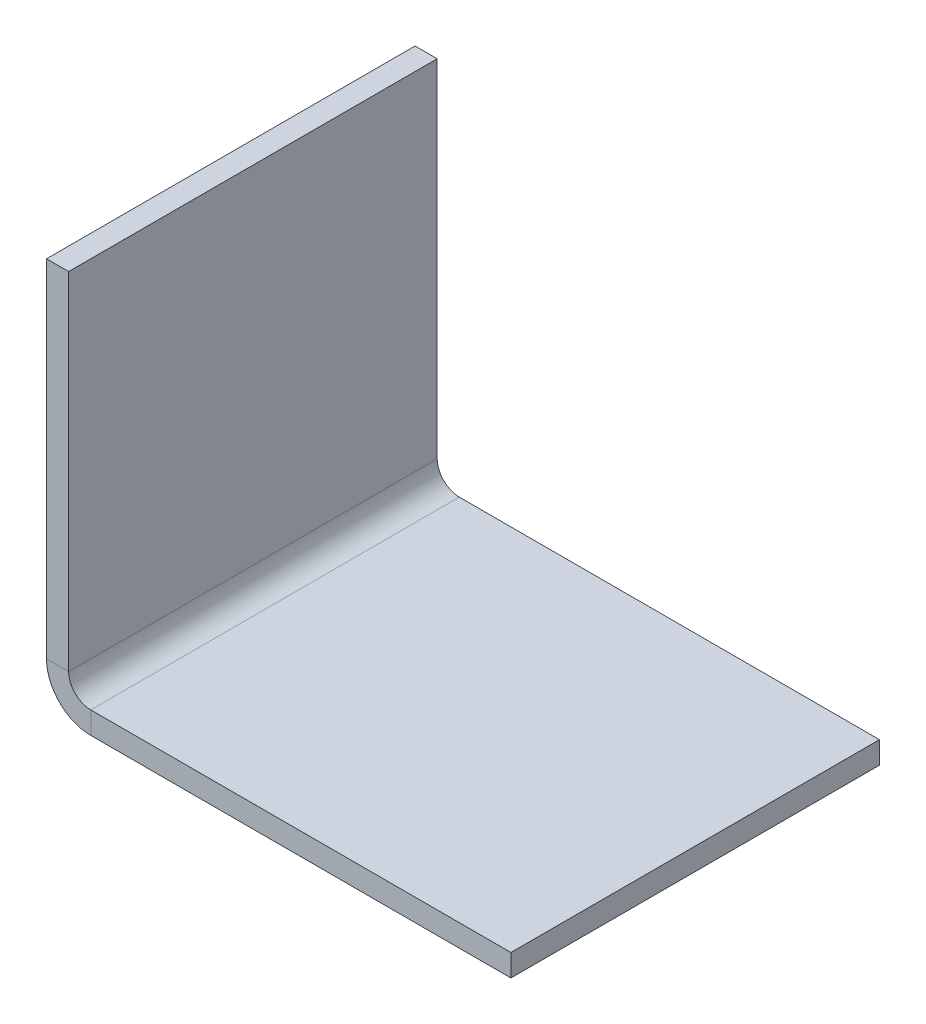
ISO-10303-21;
HEADER;
FILE_DESCRIPTION(('STEP AP214'),'2;1');
FILE_NAME('part.step','',(''),(''),'','','');
FILE_SCHEMA(('AUTOMOTIVE_DESIGN { 1 0 10303 214 1 1 1 1 }'));
ENDSEC;
DATA;
#1=APPLICATION_CONTEXT('core data for automotive mechanical design processes');
#2=APPLICATION_PROTOCOL_DEFINITION('international standard','automotive_design',2000,#1);
#3=PRODUCT_CONTEXT('',#1,'mechanical');
#4=PRODUCT('Part','Part','',(#3));
#5=PRODUCT_RELATED_PRODUCT_CATEGORY('part','',(#4));
#6=PRODUCT_DEFINITION_FORMATION('','',#4);
#7=PRODUCT_DEFINITION_CONTEXT('part definition',#1,'design');
#8=PRODUCT_DEFINITION('design','',#6,#7);
#9=PRODUCT_DEFINITION_SHAPE('','',#8);
#10=(LENGTH_UNIT() NAMED_UNIT(*) SI_UNIT(.MILLI.,.METRE.));
#11=(NAMED_UNIT(*) PLANE_ANGLE_UNIT() SI_UNIT($,.RADIAN.));
#12=(NAMED_UNIT(*) SI_UNIT($,.STERADIAN.) SOLID_ANGLE_UNIT());
#13=UNCERTAINTY_MEASURE_WITH_UNIT(LENGTH_MEASURE(1.E-05),#10,'distance_accuracy_value','');
#14=(GEOMETRIC_REPRESENTATION_CONTEXT(3) GLOBAL_UNCERTAINTY_ASSIGNED_CONTEXT((#13)) GLOBAL_UNIT_ASSIGNED_CONTEXT((#10,
#11,#12)) REPRESENTATION_CONTEXT('',''));
#15=CARTESIAN_POINT('',(0.,0.,0.));
#16=DIRECTION('',(0.,0.,1.));
#17=DIRECTION('',(1.,0.,0.));
#18=AXIS2_PLACEMENT_3D('',#15,#16,#17);
#19=CARTESIAN_POINT('',(3.,0.,50.));
#20=DIRECTION('',(0.,0.,1.));
#21=DIRECTION('',(1.,0.,0.));
#22=AXIS2_PLACEMENT_3D('',#19,#20,#21);
#23=PLANE('',#22);
#24=DIRECTION('',(0.,-1.,0.));
#25=VECTOR('',#24,1.);
#26=CARTESIAN_POINT('',(3.,0.,50.));
#27=LINE('',#26,#25);
#28=CARTESIAN_POINT('',(3.,0.,50.));
#29=VERTEX_POINT('',#28);
#30=CARTESIAN_POINT('',(3.,-3.,50.));
#31=VERTEX_POINT('',#30);
#32=EDGE_CURVE('E11',#29,#31,#27,.T.);
#33=ORIENTED_EDGE('',*,*,#32,.F.);
#34=CARTESIAN_POINT('',(3.,3.,50.));
#35=DIRECTION('',(0.,0.,-1.));
#36=DIRECTION('',(-1.,0.,0.));
#37=AXIS2_PLACEMENT_3D('',#34,#35,#36);
#38=CIRCLE('',#37,3.);
#39=CARTESIAN_POINT('',(0.,3.,50.));
#40=VERTEX_POINT('',#39);
#41=EDGE_CURVE('E138',#40,#29,#38,.F.);
#42=ORIENTED_EDGE('',*,*,#41,.F.);
#43=DIRECTION('',(1.,0.,0.));
#44=VECTOR('',#43,1.);
#45=CARTESIAN_POINT('',(-3.,3.,50.));
#46=LINE('',#45,#44);
#47=CARTESIAN_POINT('',(-3.,3.,50.));
#48=VERTEX_POINT('',#47);
#49=EDGE_CURVE('E35',#48,#40,#46,.T.);
#50=ORIENTED_EDGE('',*,*,#49,.F.);
#51=CARTESIAN_POINT('',(3.,3.,50.));
#52=DIRECTION('',(0.,0.,1.));
#53=DIRECTION('',(1.,0.,0.));
#54=AXIS2_PLACEMENT_3D('',#51,#52,#53);
#55=CIRCLE('',#54,6.);
#56=EDGE_CURVE('E149',#48,#31,#55,.T.);
#57=ORIENTED_EDGE('',*,*,#56,.T.);
#58=EDGE_LOOP('',(#33,#42,#50,#57));
#59=FACE_BOUND('',#58,.T.);
#60=ADVANCED_FACE('F28',(#59),#23,.T.);
#61=CARTESIAN_POINT('',(-3.,3.,50.));
#62=DIRECTION('',(0.,0.,1.));
#63=DIRECTION('',(1.,0.,0.));
#64=AXIS2_PLACEMENT_3D('',#61,#62,#63);
#65=PLANE('',#64);
#66=DIRECTION('',(1.,0.,0.));
#67=VECTOR('',#66,1.);
#68=CARTESIAN_POINT('',(0.,0.,50.));
#69=LINE('',#68,#67);
#70=CARTESIAN_POINT('',(60.,0.,50.));
#71=VERTEX_POINT('',#70);
#72=EDGE_CURVE('E135',#29,#71,#69,.T.);
#73=ORIENTED_EDGE('',*,*,#72,.F.);
#74=ORIENTED_EDGE('',*,*,#32,.T.);
#75=DIRECTION('',(1.,0.,0.));
#76=VECTOR('',#75,1.);
#77=CARTESIAN_POINT('',(0.,-3.,50.));
#78=LINE('',#77,#76);
#79=CARTESIAN_POINT('',(60.,-3.,50.));
#80=VERTEX_POINT('',#79);
#81=EDGE_CURVE('E132',#31,#80,#78,.T.);
#82=ORIENTED_EDGE('',*,*,#81,.T.);
#83=DIRECTION('',(0.,-1.,0.));
#84=VECTOR('',#83,1.);
#85=CARTESIAN_POINT('',(60.,0.,50.));
#86=LINE('',#85,#84);
#87=EDGE_CURVE('E97',#71,#80,#86,.T.);
#88=ORIENTED_EDGE('',*,*,#87,.F.);
#89=EDGE_LOOP('',(#73,#74,#82,#88));
#90=FACE_BOUND('',#89,.T.);
#91=ADVANCED_FACE('F192',(#90),#65,.T.);
#92=CARTESIAN_POINT('',(0.,3.,0.));
#93=DIRECTION('',(0.,0.,-1.));
#94=DIRECTION('',(-1.,0.,0.));
#95=AXIS2_PLACEMENT_3D('',#92,#93,#94);
#96=PLANE('',#95);
#97=DIRECTION('',(-1.,0.,0.));
#98=VECTOR('',#97,1.);
#99=CARTESIAN_POINT('',(0.,3.,0.));
#100=LINE('',#99,#98);
#101=CARTESIAN_POINT('',(0.,3.,0.));
#102=VERTEX_POINT('',#101);
#103=CARTESIAN_POINT('',(-3.,3.,0.));
#104=VERTEX_POINT('',#103);
#105=EDGE_CURVE('E167',#102,#104,#100,.T.);
#106=ORIENTED_EDGE('',*,*,#105,.F.);
#107=CARTESIAN_POINT('',(3.,3.,0.));
#108=DIRECTION('',(0.,0.,-1.));
#109=DIRECTION('',(-1.,0.,0.));
#110=AXIS2_PLACEMENT_3D('',#107,#108,#109);
#111=CIRCLE('',#110,3.);
#112=CARTESIAN_POINT('',(3.,0.,0.));
#113=VERTEX_POINT('',#112);
#114=EDGE_CURVE('E115',#102,#113,#111,.F.);
#115=ORIENTED_EDGE('',*,*,#114,.T.);
#116=DIRECTION('',(0.,1.,0.));
#117=VECTOR('',#116,1.);
#118=CARTESIAN_POINT('',(3.,-3.,0.));
#119=LINE('',#118,#117);
#120=CARTESIAN_POINT('',(3.,-3.,0.));
#121=VERTEX_POINT('',#120);
#122=EDGE_CURVE('E100',#121,#113,#119,.T.);
#123=ORIENTED_EDGE('',*,*,#122,.F.);
#124=CARTESIAN_POINT('',(3.,3.,0.));
#125=DIRECTION('',(0.,0.,1.));
#126=DIRECTION('',(1.,0.,0.));
#127=AXIS2_PLACEMENT_3D('',#124,#125,#126);
#128=CIRCLE('',#127,6.);
#129=EDGE_CURVE('E129',#104,#121,#128,.T.);
#130=ORIENTED_EDGE('',*,*,#129,.F.);
#131=EDGE_LOOP('',(#106,#115,#123,#130));
#132=FACE_BOUND('',#131,.T.);
#133=ADVANCED_FACE('F196',(#132),#96,.T.);
#134=CARTESIAN_POINT('',(3.,-3.,0.));
#135=DIRECTION('',(0.,0.,-1.));
#136=DIRECTION('',(-1.,0.,0.));
#137=AXIS2_PLACEMENT_3D('',#134,#135,#136);
#138=PLANE('',#137);
#139=DIRECTION('',(0.,-1.,0.));
#140=VECTOR('',#139,1.);
#141=CARTESIAN_POINT('',(0.,50.,0.));
#142=LINE('',#141,#140);
#143=CARTESIAN_POINT('',(0.,50.,0.));
#144=VERTEX_POINT('',#143);
#145=EDGE_CURVE('E120',#144,#102,#142,.T.);
#146=ORIENTED_EDGE('',*,*,#145,.T.);
#147=ORIENTED_EDGE('',*,*,#105,.T.);
#148=DIRECTION('',(0.,-1.,0.));
#149=VECTOR('',#148,1.);
#150=CARTESIAN_POINT('',(-3.,50.,0.));
#151=LINE('',#150,#149);
#152=CARTESIAN_POINT('',(-3.,50.,0.));
#153=VERTEX_POINT('',#152);
#154=EDGE_CURVE('E126',#153,#104,#151,.T.);
#155=ORIENTED_EDGE('',*,*,#154,.F.);
#156=DIRECTION('',(1.,0.,0.));
#157=VECTOR('',#156,1.);
#158=CARTESIAN_POINT('',(-3.,50.,0.));
#159=LINE('',#158,#157);
#160=EDGE_CURVE('E123',#153,#144,#159,.T.);
#161=ORIENTED_EDGE('',*,*,#160,.T.);
#162=EDGE_LOOP('',(#146,#147,#155,#161));
#163=FACE_BOUND('',#162,.T.);
#164=ADVANCED_FACE('F198',(#163),#138,.T.);
#165=CARTESIAN_POINT('',(0.,-3.,50.));
#166=DIRECTION('',(0.,1.,0.));
#167=DIRECTION('',(-1.,0.,0.));
#168=AXIS2_PLACEMENT_3D('',#165,#166,#167);
#169=PLANE('',#168);
#170=DIRECTION('',(1.,0.,0.));
#171=VECTOR('',#170,1.);
#172=CARTESIAN_POINT('',(0.,-3.,0.));
#173=LINE('',#172,#171);
#174=CARTESIAN_POINT('',(60.,-3.,0.));
#175=VERTEX_POINT('',#174);
#176=EDGE_CURVE('E105',#121,#175,#173,.T.);
#177=ORIENTED_EDGE('',*,*,#176,.T.);
#178=DIRECTION('',(0.,0.,-1.));
#179=VECTOR('',#178,1.);
#180=CARTESIAN_POINT('',(60.,-3.,50.));
#181=LINE('',#180,#179);
#182=EDGE_CURVE('E90',#80,#175,#181,.T.);
#183=ORIENTED_EDGE('',*,*,#182,.F.);
#184=ORIENTED_EDGE('',*,*,#81,.F.);
#185=DIRECTION('',(0.,0.,-1.));
#186=VECTOR('',#185,1.);
#187=CARTESIAN_POINT('',(3.,-3.,50.));
#188=LINE('',#187,#186);
#189=EDGE_CURVE('E108',#31,#121,#188,.T.);
#190=ORIENTED_EDGE('',*,*,#189,.T.);
#191=EDGE_LOOP('',(#177,#183,#184,#190));
#192=FACE_BOUND('',#191,.T.);
#193=ADVANCED_FACE('F106',(#192),#169,.F.);
#194=CARTESIAN_POINT('',(60.,0.,50.));
#195=DIRECTION('',(1.,0.,0.));
#196=DIRECTION('',(0.,0.,-1.));
#197=AXIS2_PLACEMENT_3D('',#194,#195,#196);
#198=PLANE('',#197);
#199=DIRECTION('',(0.,-1.,0.));
#200=VECTOR('',#199,1.);
#201=CARTESIAN_POINT('',(60.,0.,0.));
#202=LINE('',#201,#200);
#203=CARTESIAN_POINT('',(60.,0.,0.));
#204=VERTEX_POINT('',#203);
#205=EDGE_CURVE('E94',#204,#175,#202,.T.);
#206=ORIENTED_EDGE('',*,*,#205,.F.);
#207=DIRECTION('',(0.,0.,-1.));
#208=VECTOR('',#207,1.);
#209=CARTESIAN_POINT('',(60.,0.,50.));
#210=LINE('',#209,#208);
#211=EDGE_CURVE('E101',#71,#204,#210,.T.);
#212=ORIENTED_EDGE('',*,*,#211,.F.);
#213=ORIENTED_EDGE('',*,*,#87,.T.);
#214=ORIENTED_EDGE('',*,*,#182,.T.);
#215=EDGE_LOOP('',(#206,#212,#213,#214));
#216=FACE_BOUND('',#215,.T.);
#217=ADVANCED_FACE('F92',(#216),#198,.T.);
#218=CARTESIAN_POINT('',(0.,0.,50.));
#219=DIRECTION('',(0.,1.,0.));
#220=DIRECTION('',(-1.,0.,0.));
#221=AXIS2_PLACEMENT_3D('',#218,#219,#220);
#222=PLANE('',#221);
#223=DIRECTION('',(1.,0.,0.));
#224=VECTOR('',#223,1.);
#225=CARTESIAN_POINT('',(0.,0.,0.));
#226=LINE('',#225,#224);
#227=EDGE_CURVE('E113',#113,#204,#226,.T.);
#228=ORIENTED_EDGE('',*,*,#227,.F.);
#229=DIRECTION('',(0.,0.,-1.));
#230=VECTOR('',#229,1.);
#231=CARTESIAN_POINT('',(3.,0.,50.));
#232=LINE('',#231,#230);
#233=EDGE_CURVE('E162',#29,#113,#232,.T.);
#234=ORIENTED_EDGE('',*,*,#233,.F.);
#235=ORIENTED_EDGE('',*,*,#72,.T.);
#236=ORIENTED_EDGE('',*,*,#211,.T.);
#237=EDGE_LOOP('',(#228,#234,#235,#236));
#238=FACE_BOUND('',#237,.T.);
#239=ADVANCED_FACE('F194',(#238),#222,.T.);
#240=CARTESIAN_POINT('',(3.,3.,50.));
#241=DIRECTION('',(0.,0.,-1.));
#242=DIRECTION('',(-1.,0.,0.));
#243=AXIS2_PLACEMENT_3D('',#240,#241,#242);
#244=CYLINDRICAL_SURFACE('',#243,3.);
#245=ORIENTED_EDGE('',*,*,#114,.F.);
#246=DIRECTION('',(0.,0.,-1.));
#247=VECTOR('',#246,1.);
#248=CARTESIAN_POINT('',(0.,3.,50.));
#249=LINE('',#248,#247);
#250=EDGE_CURVE('E159',#40,#102,#249,.T.);
#251=ORIENTED_EDGE('',*,*,#250,.F.);
#252=ORIENTED_EDGE('',*,*,#41,.T.);
#253=ORIENTED_EDGE('',*,*,#233,.T.);
#254=EDGE_LOOP('',(#245,#251,#252,#253));
#255=FACE_BOUND('',#254,.T.);
#256=ADVANCED_FACE('F177',(#255),#244,.F.);
#257=CARTESIAN_POINT('',(0.,50.,50.));
#258=DIRECTION('',(1.,0.,0.));
#259=DIRECTION('',(0.,1.,0.));
#260=AXIS2_PLACEMENT_3D('',#257,#258,#259);
#261=PLANE('',#260);
#262=ORIENTED_EDGE('',*,*,#145,.F.);
#263=DIRECTION('',(0.,0.,-1.));
#264=VECTOR('',#263,1.);
#265=CARTESIAN_POINT('',(0.,50.,50.));
#266=LINE('',#265,#264);
#267=CARTESIAN_POINT('',(0.,50.,50.));
#268=VERTEX_POINT('',#267);
#269=EDGE_CURVE('E157',#268,#144,#266,.T.);
#270=ORIENTED_EDGE('',*,*,#269,.F.);
#271=DIRECTION('',(0.,-1.,0.));
#272=VECTOR('',#271,1.);
#273=CARTESIAN_POINT('',(0.,50.,50.));
#274=LINE('',#273,#272);
#275=EDGE_CURVE('E141',#268,#40,#274,.T.);
#276=ORIENTED_EDGE('',*,*,#275,.T.);
#277=ORIENTED_EDGE('',*,*,#250,.T.);
#278=EDGE_LOOP('',(#262,#270,#276,#277));
#279=FACE_BOUND('',#278,.T.);
#280=ADVANCED_FACE('F181',(#279),#261,.T.);
#281=CARTESIAN_POINT('',(-3.,50.,50.));
#282=DIRECTION('',(0.,1.,0.));
#283=DIRECTION('',(0.,0.,1.));
#284=AXIS2_PLACEMENT_3D('',#281,#282,#283);
#285=PLANE('',#284);
#286=ORIENTED_EDGE('',*,*,#160,.F.);
#287=DIRECTION('',(0.,0.,-1.));
#288=VECTOR('',#287,1.);
#289=CARTESIAN_POINT('',(-3.,50.,50.));
#290=LINE('',#289,#288);
#291=CARTESIAN_POINT('',(-3.,50.,50.));
#292=VERTEX_POINT('',#291);
#293=EDGE_CURVE('E155',#292,#153,#290,.T.);
#294=ORIENTED_EDGE('',*,*,#293,.F.);
#295=DIRECTION('',(1.,0.,0.));
#296=VECTOR('',#295,1.);
#297=CARTESIAN_POINT('',(-3.,50.,50.));
#298=LINE('',#297,#296);
#299=EDGE_CURVE('E144',#292,#268,#298,.T.);
#300=ORIENTED_EDGE('',*,*,#299,.T.);
#301=ORIENTED_EDGE('',*,*,#269,.T.);
#302=EDGE_LOOP('',(#286,#294,#300,#301));
#303=FACE_BOUND('',#302,.T.);
#304=ADVANCED_FACE('F184',(#303),#285,.T.);
#305=CARTESIAN_POINT('',(-3.,50.,50.));
#306=DIRECTION('',(1.,0.,0.));
#307=DIRECTION('',(0.,1.,0.));
#308=AXIS2_PLACEMENT_3D('',#305,#306,#307);
#309=PLANE('',#308);
#310=ORIENTED_EDGE('',*,*,#154,.T.);
#311=DIRECTION('',(0.,0.,-1.));
#312=VECTOR('',#311,1.);
#313=CARTESIAN_POINT('',(-3.,3.,50.));
#314=LINE('',#313,#312);
#315=EDGE_CURVE('E152',#48,#104,#314,.T.);
#316=ORIENTED_EDGE('',*,*,#315,.F.);
#317=DIRECTION('',(0.,-1.,0.));
#318=VECTOR('',#317,1.);
#319=CARTESIAN_POINT('',(-3.,50.,50.));
#320=LINE('',#319,#318);
#321=EDGE_CURVE('E147',#292,#48,#320,.T.);
#322=ORIENTED_EDGE('',*,*,#321,.F.);
#323=ORIENTED_EDGE('',*,*,#293,.T.);
#324=EDGE_LOOP('',(#310,#316,#322,#323));
#325=FACE_BOUND('',#324,.T.);
#326=ADVANCED_FACE('F187',(#325),#309,.F.);
#327=CARTESIAN_POINT('',(3.,3.,50.));
#328=DIRECTION('',(0.,0.,-1.));
#329=DIRECTION('',(-1.,0.,0.));
#330=AXIS2_PLACEMENT_3D('',#327,#328,#329);
#331=CYLINDRICAL_SURFACE('',#330,6.);
#332=ORIENTED_EDGE('',*,*,#129,.T.);
#333=ORIENTED_EDGE('',*,*,#189,.F.);
#334=ORIENTED_EDGE('',*,*,#56,.F.);
#335=ORIENTED_EDGE('',*,*,#315,.T.);
#336=EDGE_LOOP('',(#332,#333,#334,#335));
#337=FACE_BOUND('',#336,.T.);
#338=ADVANCED_FACE('F191',(#337),#331,.T.);
#339=CARTESIAN_POINT('',(3.,3.,50.));
#340=DIRECTION('',(0.,0.,-1.));
#341=DIRECTION('',(-1.,0.,0.));
#342=AXIS2_PLACEMENT_3D('',#339,#340,#341);
#343=PLANE('',#342);
#344=ORIENTED_EDGE('',*,*,#321,.T.);
#345=ORIENTED_EDGE('',*,*,#49,.T.);
#346=ORIENTED_EDGE('',*,*,#275,.F.);
#347=ORIENTED_EDGE('',*,*,#299,.F.);
#348=EDGE_LOOP('',(#344,#345,#346,#347));
#349=FACE_BOUND('',#348,.T.);
#350=ADVANCED_FACE('F171',(#349),#343,.F.);
#351=CARTESIAN_POINT('',(3.,3.,0.));
#352=DIRECTION('',(0.,0.,-1.));
#353=DIRECTION('',(-1.,0.,0.));
#354=AXIS2_PLACEMENT_3D('',#351,#352,#353);
#355=PLANE('',#354);
#356=ORIENTED_EDGE('',*,*,#176,.F.);
#357=ORIENTED_EDGE('',*,*,#122,.T.);
#358=ORIENTED_EDGE('',*,*,#227,.T.);
#359=ORIENTED_EDGE('',*,*,#205,.T.);
#360=EDGE_LOOP('',(#356,#357,#358,#359));
#361=FACE_BOUND('',#360,.T.);
#362=ADVANCED_FACE('F111',(#361),#355,.T.);
#363=CLOSED_SHELL('',(#60,#91,#133,#164,#193,#217,#239,#256,#280,#304,#326,#338,#350,#362));
#364=MANIFOLD_SOLID_BREP('B2',#363);
#365=ADVANCED_BREP_SHAPE_REPRESENTATION('',(#18,#364),#14);
#366=SHAPE_DEFINITION_REPRESENTATION(#9,#365);
ENDSEC;
END-ISO-10303-21;
